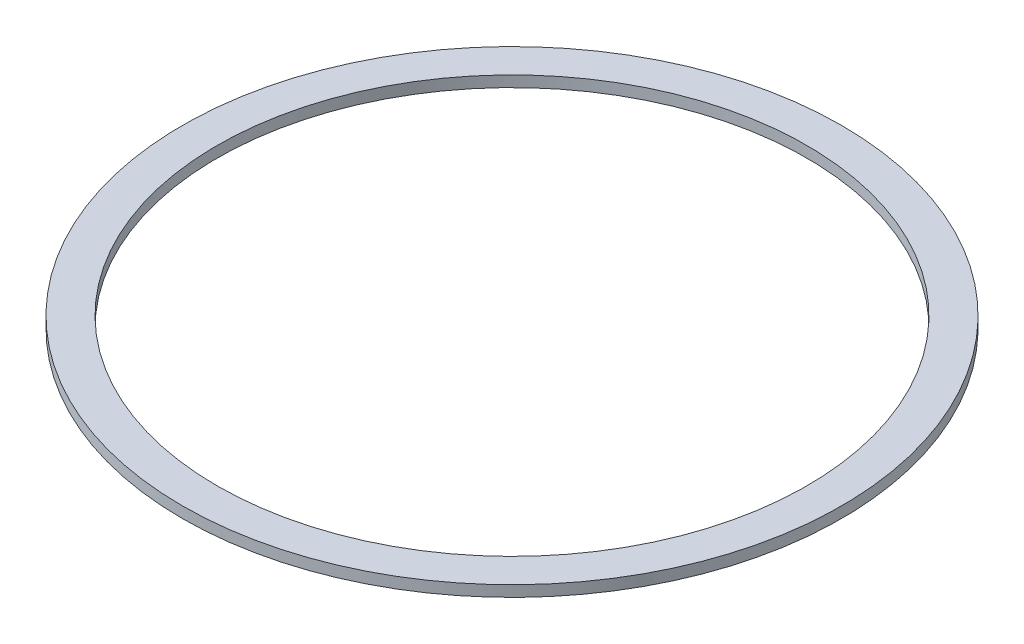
ISO-10303-21;
HEADER;
FILE_DESCRIPTION(('STEP AP214'),'2;1');
FILE_NAME('part.step','',(''),(''),'','','');
FILE_SCHEMA(('AUTOMOTIVE_DESIGN { 1 0 10303 214 1 1 1 1 }'));
ENDSEC;
DATA;
#1=APPLICATION_CONTEXT('core data for automotive mechanical design processes');
#2=APPLICATION_PROTOCOL_DEFINITION('international standard','automotive_design',2000,#1);
#3=PRODUCT_CONTEXT('',#1,'mechanical');
#4=PRODUCT('Part','Part','',(#3));
#5=PRODUCT_RELATED_PRODUCT_CATEGORY('part','',(#4));
#6=PRODUCT_DEFINITION_FORMATION('','',#4);
#7=PRODUCT_DEFINITION_CONTEXT('part definition',#1,'design');
#8=PRODUCT_DEFINITION('design','',#6,#7);
#9=PRODUCT_DEFINITION_SHAPE('','',#8);
#10=(LENGTH_UNIT() NAMED_UNIT(*) SI_UNIT(.MILLI.,.METRE.));
#11=(NAMED_UNIT(*) PLANE_ANGLE_UNIT() SI_UNIT($,.RADIAN.));
#12=(NAMED_UNIT(*) SI_UNIT($,.STERADIAN.) SOLID_ANGLE_UNIT());
#13=UNCERTAINTY_MEASURE_WITH_UNIT(LENGTH_MEASURE(1.E-05),#10,'distance_accuracy_value','');
#14=(GEOMETRIC_REPRESENTATION_CONTEXT(3) GLOBAL_UNCERTAINTY_ASSIGNED_CONTEXT((#13)) GLOBAL_UNIT_ASSIGNED_CONTEXT((#10,
#11,#12)) REPRESENTATION_CONTEXT('',''));
#15=CARTESIAN_POINT('',(0.,0.,0.));
#16=DIRECTION('',(0.,0.,1.));
#17=DIRECTION('',(1.,0.,0.));
#18=AXIS2_PLACEMENT_3D('',#15,#16,#17);
#19=CARTESIAN_POINT('',(0.,0.79375,0.));
#20=DIRECTION('',(0.,1.,0.));
#21=DIRECTION('',(0.,0.,1.));
#22=AXIS2_PLACEMENT_3D('',#19,#20,#21);
#23=PLANE('',#22);
#24=CARTESIAN_POINT('',(0.,0.79375,0.));
#25=DIRECTION('',(0.,1.,0.));
#26=DIRECTION('',(0.,0.,1.));
#27=AXIS2_PLACEMENT_3D('',#24,#25,#26);
#28=CIRCLE('',#27,23.75);
#29=CARTESIAN_POINT('',(0.,0.79375,23.75));
#30=VERTEX_POINT('',#29);
#31=EDGE_CURVE('E10',#30,#30,#28,.T.);
#32=ORIENTED_EDGE('',*,*,#31,.T.);
#33=EDGE_LOOP('',(#32));
#34=FACE_BOUND('',#33,.T.);
#35=CARTESIAN_POINT('',(0.,0.79375,0.));
#36=DIRECTION('',(0.,1.,0.));
#37=DIRECTION('',(0.,0.,1.));
#38=AXIS2_PLACEMENT_3D('',#35,#36,#37);
#39=CIRCLE('',#38,21.25);
#40=CARTESIAN_POINT('',(0.,0.79375,21.25));
#41=VERTEX_POINT('',#40);
#42=EDGE_CURVE('E51',#41,#41,#39,.T.);
#43=ORIENTED_EDGE('',*,*,#42,.F.);
#44=EDGE_LOOP('',(#43));
#45=FACE_BOUND('',#44,.T.);
#46=ADVANCED_FACE('F37',(#34,#45),#23,.T.);
#47=CARTESIAN_POINT('',(0.,0.,0.));
#48=DIRECTION('',(0.,1.,0.));
#49=DIRECTION('',(0.,0.,1.));
#50=AXIS2_PLACEMENT_3D('',#47,#48,#49);
#51=PLANE('',#50);
#52=CARTESIAN_POINT('',(0.,0.,0.));
#53=DIRECTION('',(0.,1.,0.));
#54=DIRECTION('',(0.,0.,1.));
#55=AXIS2_PLACEMENT_3D('',#52,#53,#54);
#56=CIRCLE('',#55,23.75);
#57=CARTESIAN_POINT('',(0.,0.,23.75));
#58=VERTEX_POINT('',#57);
#59=EDGE_CURVE('E41',#58,#58,#56,.T.);
#60=ORIENTED_EDGE('',*,*,#59,.F.);
#61=EDGE_LOOP('',(#60));
#62=FACE_BOUND('',#61,.T.);
#63=CARTESIAN_POINT('',(0.,0.,0.));
#64=DIRECTION('',(0.,1.,0.));
#65=DIRECTION('',(0.,0.,1.));
#66=AXIS2_PLACEMENT_3D('',#63,#64,#65);
#67=CIRCLE('',#66,21.25);
#68=CARTESIAN_POINT('',(0.,0.,21.25));
#69=VERTEX_POINT('',#68);
#70=EDGE_CURVE('E53',#69,#69,#67,.T.);
#71=ORIENTED_EDGE('',*,*,#70,.T.);
#72=EDGE_LOOP('',(#71));
#73=FACE_BOUND('',#72,.T.);
#74=ADVANCED_FACE('F66',(#62,#73),#51,.F.);
#75=CARTESIAN_POINT('',(0.,0.79375,0.));
#76=DIRECTION('',(0.,-1.,0.));
#77=DIRECTION('',(0.,0.,-1.));
#78=AXIS2_PLACEMENT_3D('',#75,#76,#77);
#79=CYLINDRICAL_SURFACE('',#78,23.75);
#80=ORIENTED_EDGE('',*,*,#31,.F.);
#81=EDGE_LOOP('',(#80));
#82=FACE_BOUND('',#81,.T.);
#83=ORIENTED_EDGE('',*,*,#59,.T.);
#84=EDGE_LOOP('',(#83));
#85=FACE_BOUND('',#84,.T.);
#86=ADVANCED_FACE('F39',(#82,#85),#79,.T.);
#87=CARTESIAN_POINT('',(0.,0.79375,0.));
#88=DIRECTION('',(0.,-1.,0.));
#89=DIRECTION('',(0.,0.,-1.));
#90=AXIS2_PLACEMENT_3D('',#87,#88,#89);
#91=CYLINDRICAL_SURFACE('',#90,21.25);
#92=ORIENTED_EDGE('',*,*,#42,.T.);
#93=EDGE_LOOP('',(#92));
#94=FACE_BOUND('',#93,.T.);
#95=ORIENTED_EDGE('',*,*,#70,.F.);
#96=EDGE_LOOP('',(#95));
#97=FACE_BOUND('',#96,.T.);
#98=ADVANCED_FACE('F62',(#94,#97),#91,.F.);
#99=CLOSED_SHELL('',(#46,#74,#86,#98));
#100=MANIFOLD_SOLID_BREP('B2',#99);
#101=ADVANCED_BREP_SHAPE_REPRESENTATION('',(#18,#100),#14);
#102=SHAPE_DEFINITION_REPRESENTATION(#9,#101);
ENDSEC;
END-ISO-10303-21;
